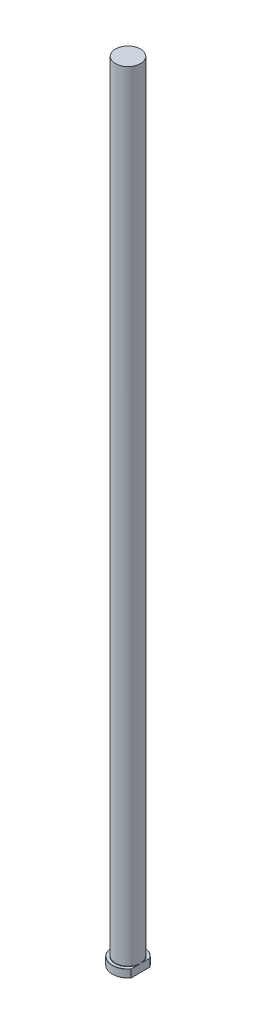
from build123d import *
from build123d.topology import SkipClean

# Parameters (mm, degrees)
CHAMFER1_SIZE = 0.2
FILLET1_R     = 0.3
KEY_DEPTH     = 1001.399920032


with BuildPart() as part:
    # Sketch1 → Revolve1 (revolve)
    with BuildSketch(Plane.XY, mode=Mode.PRIVATE) as revolve1_sk:
        Polygon((0, 0), (-20, 0), (-20, 10), (-16, 10), (-16, 1000), (0, 1000), align=None)
    revolve(revolve1_sk.sketch.rotate(Axis((0, 259.958771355, 0), (0, -1, 0)), 270), axis=Axis((0, 259.958771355, 0), (0, -1, 0)))

    # Chamfer1
    chamfer1_edges = [part.edges().sort_by_distance(p)[0] for p in [
        (0, 10, -20),
        (0, 0, -20),
    ]]
    chamfer(chamfer1_edges, length=CHAMFER1_SIZE)

    # Fillet1
    fillet1_edges = [part.edges().sort_by_distance(p)[0] for p in [
        (0, 10, -16),
    ]]
    fillet(fillet1_edges, radius=FILLET1_R)

    # Sketch2 → KEY (cut, through all)
    with SkipClean():  # the faces are left unmerged after this step: merging them gives an invalid solid
        with BuildSketch(Plane(origin=(0, 0, 0), x_dir=(1, 0, 0), z_dir=(0, 1, 0))):
            with BuildLine():
                Line((16, 12), (16, -12))
                ThreePointArc((16, -12), (20, 0), (16, 12))
            make_face()
        extrude(amount=KEY_DEPTH, mode=Mode.SUBTRACT)


solid = part.part
